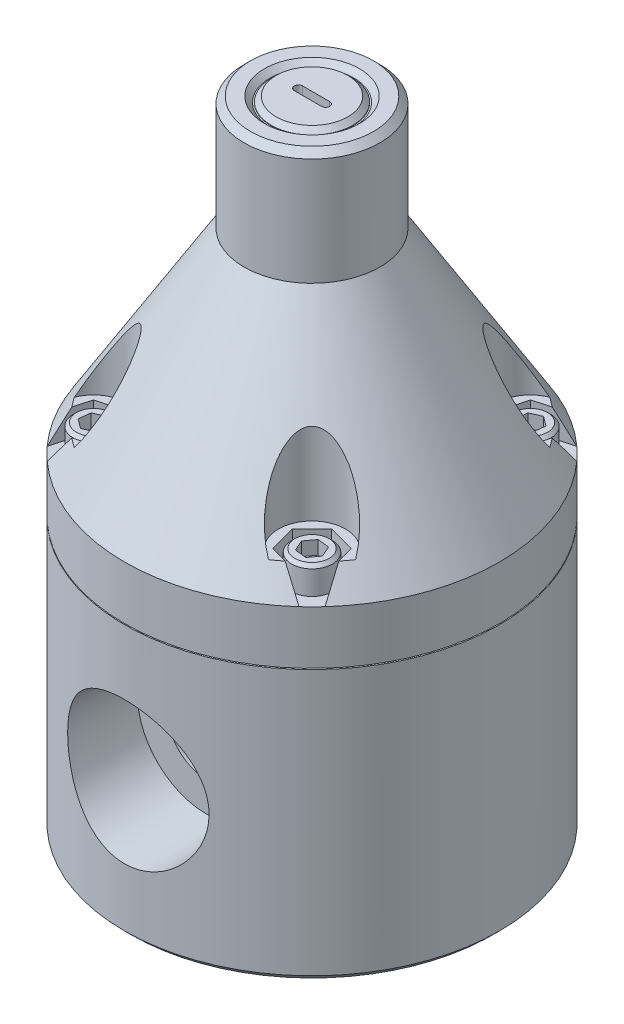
from build123d import *

# Parameters (mm, degrees)
SKETCH1_R         = 43.815
EXTRUDE1_DEPTH    = 148.59
CHAMFER1_SIZE     = 1.524
SKETCH3_R         = 11.1125
EXTRUDE2_DEPTH    = 1.27
EXTRUDE2_DRAFT    = -45
SKETCH4_R         = 9.525
EXTRUDE3_DEPTH    = 1.27
CHAMFER2_SIZE     = 1.143
EXTRUDE4_DEPTH    = 3.175
EXTRUDE4_DRAFT    = -1
SKETCH6_R         = 7.874
EXTRUDE5_DEPTH    = 22.86
EXTRUDE6_DEPTH    = 6.35
SKETCH8_R         = 4.7625
EXTRUDE7_DEPTH    = 6.35
EXTRUDE8_DEPTH    = 3.175
CIRPATTERN1_COUNT = 4
CHAMFER3_SIZE     = 0.762


with BuildPart() as part:
    # Sketch1 → Extrude1 (new body)
    with BuildSketch(Plane(origin=(0, 0, 0), x_dir=(1, 0, 0), z_dir=(0, 1, 0))):
        with Locations(Location((0, 0, 0), (0, 0, 270))):
            Circle(SKETCH1_R)
    extrude(amount=EXTRUDE1_DEPTH)

    # Sketch2 → Cut-Revolve1 (revolve, cut)
    with BuildSketch(Plane.XY, mode=Mode.PRIVATE) as cut_revolve1_sk:
        Polygon((-52.628834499, 63.5), (-30.226, 63.5), (-30.226, 63.754), (-43.815, 63.754), (-43.815, 76.2), (-15.875, 121.92), (-15.875, 152.4), (-52.628834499, 152.4), align=None)
    revolve(cut_revolve1_sk.sketch.rotate(Axis((0, 148.59, 0), (0, -1, 0)), 270), axis=Axis((0, 148.59, 0), (0, -1, 0)), mode=Mode.SUBTRACT)

    # Chamfer1
    chamfer1_edges = [part.edges().sort_by_distance(p)[0] for p in [
        (0, 0, -43.815),
        (0, 148.59, -15.875),
    ]]
    chamfer(chamfer1_edges, length=CHAMFER1_SIZE)


with BuildPart() as extrude2_tool:
    # Sketch3 → Extrude2 (with draft: the straight prism first)
    with BuildSketch(Plane(origin=(0, 148.59, 0), x_dir=(-1, 0, 0), z_dir=(0, 1, 0))):
        Circle(SKETCH3_R)
    extrude(amount=-EXTRUDE2_DEPTH)
    # Extrude2: the draft: its side faces are tilted about the plane it starts from
    extrude2_sides = [extrude2_tool.faces().sort_by_distance(p)[0] for p in [
        (11.1125, 147.955, 0),
    ]]
    draft(extrude2_sides, Plane(origin=(0, 148.59, 0), x_dir=(-1, 0, 0), z_dir=(0, 1, 0)), EXTRUDE2_DRAFT)


with BuildPart() as part_1:
    add(part.part)

    # Extrude2: cut by extrude2_tool
    add(extrude2_tool.part, mode=Mode.SUBTRACT)

    # Sketch4 → Extrude3 (add)
    with BuildSketch(Plane(origin=(0, 148.59, 0), x_dir=(-1, 0, 0), z_dir=(0, 1, 0))):
        with Locations(Location((0, 0, 0), (0, 0, 90))):
            Circle(SKETCH4_R)
    extrude(amount=-EXTRUDE3_DEPTH)

    # Chamfer2
    chamfer2_edges = [part_1.edges().sort_by_distance(p)[0] for p in [
        (0, 148.59, -9.525),
    ]]
    chamfer(chamfer2_edges, length=CHAMFER2_SIZE)


with BuildPart() as extrude4_tool:
    # Sketch5 → Extrude4 (with draft: the straight prism first)
    with BuildSketch(Plane(origin=(0, 148.59, 0), x_dir=(-1, 0, 0), z_dir=(0, 1, 0))):
        with BuildLine():
            Line((3.175, 0.9652), (-3.175, 0.9652))
            ThreePointArc((-3.175, 0.9652), (-4.1402, 0), (-3.175, -0.9652))
            Line((-3.175, -0.9652), (3.175, -0.9652))
            ThreePointArc((3.175, -0.9652), (4.1402, 0), (3.175, 0.9652))
        make_face()
    extrude(amount=-EXTRUDE4_DEPTH)
    # Extrude4: the draft: its side faces are tilted about the plane it starts from
    extrude4_sides = [extrude4_tool.faces().sort_by_distance(p)[0] for p in [
        (0, 147.0025, 0.9652),
        (4.1402, 147.0025, 0),
        (0, 147.0025, -0.9652),
        (-4.1402, 147.0025, 0),
    ]]
    draft(extrude4_sides, Plane(origin=(0, 148.59, 0), x_dir=(-1, 0, 0), z_dir=(0, 1, 0)), EXTRUDE4_DRAFT)


with BuildPart() as part_2:
    add(part_1.part)

    # Extrude4: cut by extrude4_tool
    add(extrude4_tool.part, mode=Mode.SUBTRACT)

    # Sketch6 → Extrude5 (cut)
    with BuildSketch(Plane(origin=(0, 82.55, 0), x_dir=(-1, 0, 0), z_dir=(0, 1, 0))):
        with Locations((-25.521887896, 25.521887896)):
            Circle(SKETCH6_R)
    extrude5 = extrude(amount=EXTRUDE5_DEPTH, mode=Mode.SUBTRACT)

    # Sketch7 → Extrude6 (cut)
    with BuildSketch(Plane(origin=(0, 82.55, 0), x_dir=(-1, 0, 0), z_dir=(0, 1, 0))):
        Polygon((-30.08447079, 20.959305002), (-23.85186665, 19.289283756), (-19.289283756, 23.85186665), (-20.959305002, 30.08447079), (-33.653634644, 33.653634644), align=None)
    extrude6 = extrude(amount=-EXTRUDE6_DEPTH, mode=Mode.SUBTRACT)

    # Sketch8 → Extrude7 (add)
    with BuildSketch(Plane(origin=(0, 82.55, 0), x_dir=(-1, 0, 0), z_dir=(0, 1, 0))):
        with Locations(Location((-25.521887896, 25.521887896, 0), (0, 0, 90))):
            Circle(SKETCH8_R)
    extrude7 = extrude(amount=-EXTRUDE7_DEPTH)

    # Sketch9 → Extrude8 (cut)
    with BuildSketch(Plane(origin=(0, 82.55, 0), x_dir=(-1, 0, 0), z_dir=(0, 1, 0))):
        Polygon((-23.873856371, 27.745151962), (-26.623275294, 28.060757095), (-28.271306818, 25.83749303), (-27.169919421, 23.298623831), (-24.420500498, 22.983018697), (-22.772468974, 25.206282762), align=None)
    extrude8 = extrude(amount=-EXTRUDE8_DEPTH, mode=Mode.SUBTRACT)

    # CirPattern1: Extrude5, Extrude6, Extrude7, Extrude8 ×4 about axis
    cirpattern1_axis = Axis((0, 0, 0), (0, 1, 0))
    add([extrude5.rotate(cirpattern1_axis, i * 360 / CIRPATTERN1_COUNT) for i in range(1, CIRPATTERN1_COUNT)], mode=Mode.SUBTRACT)
    add([extrude6.rotate(cirpattern1_axis, i * 360 / CIRPATTERN1_COUNT) for i in range(1, CIRPATTERN1_COUNT)], mode=Mode.SUBTRACT)
    add([extrude7.rotate(cirpattern1_axis, i * 360 / CIRPATTERN1_COUNT) for i in range(1, CIRPATTERN1_COUNT)])
    add([extrude8.rotate(cirpattern1_axis, i * 360 / CIRPATTERN1_COUNT) for i in range(1, CIRPATTERN1_COUNT)], mode=Mode.SUBTRACT)

    # Chamfer3
    chamfer3_edges = [part_2.edges().sort_by_distance(p)[0] for p in [
        (-20.759387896, 82.55, 25.521887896),
        (-25.521887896, 82.55, -20.759387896),
        (20.759387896, 82.55, -25.521887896),
        (25.521887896, 82.55, 20.759387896),
    ]]
    chamfer(chamfer3_edges, length=CHAMFER3_SIZE)

    # Sketch12 → 1 Rc Tapped Hole1 (revolve, cut)
    with BuildSketch(Plane(origin=(0, 31.75, 43.815), x_dir=(0, -1, 0), z_dir=(1, 0, 0))):
        Polygon((0, 0), (0, 35.887745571), (9, 30.48), (9, 19.05), (16.031384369, 19.05), (16.626061, 0), align=None)
    f_1_rc_tapped_hole1 = revolve(axis=Axis((0, 31.75, 50.165), (0, 0, -1)), mode=Mode.SUBTRACT)

    # Mirror1: 1 Rc Tapped Hole1 across plane
    add(f_1_rc_tapped_hole1.mirror(Plane.XY), mode=Mode.SUBTRACT)


solid = part_2.part
